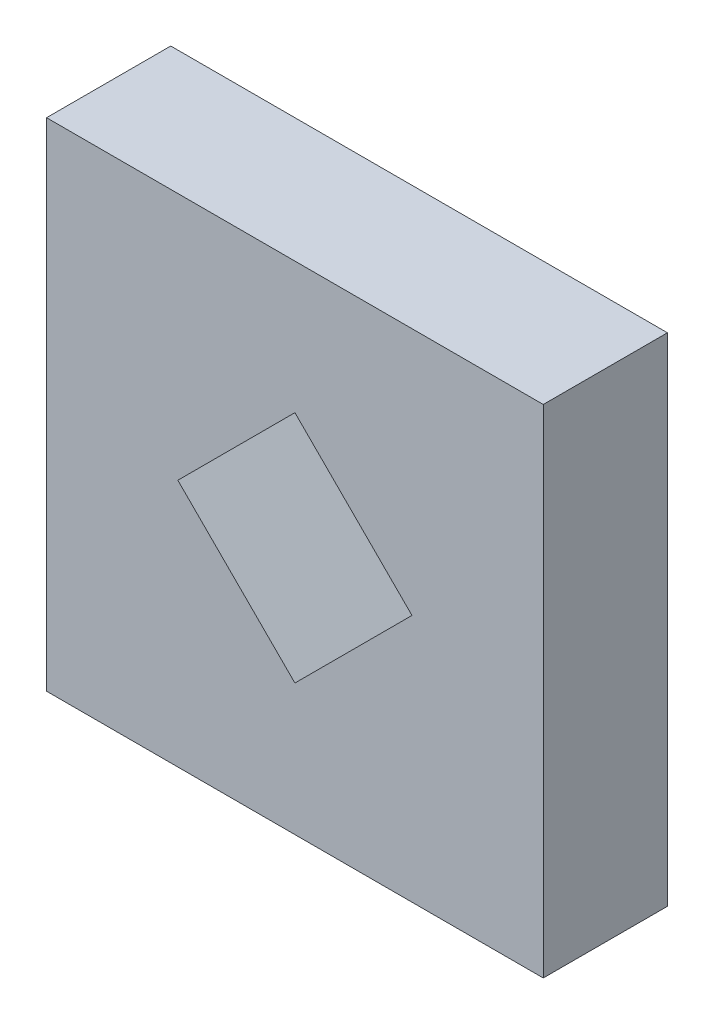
ISO-10303-21;
HEADER;
FILE_DESCRIPTION(('STEP AP214'),'2;1');
FILE_NAME('part.step','',(''),(''),'','','');
FILE_SCHEMA(('AUTOMOTIVE_DESIGN { 1 0 10303 214 1 1 1 1 }'));
ENDSEC;
DATA;
#1=APPLICATION_CONTEXT('core data for automotive mechanical design processes');
#2=APPLICATION_PROTOCOL_DEFINITION('international standard','automotive_design',2000,#1);
#3=PRODUCT_CONTEXT('',#1,'mechanical');
#4=PRODUCT('Part','Part','',(#3));
#5=PRODUCT_RELATED_PRODUCT_CATEGORY('part','',(#4));
#6=PRODUCT_DEFINITION_FORMATION('','',#4);
#7=PRODUCT_DEFINITION_CONTEXT('part definition',#1,'design');
#8=PRODUCT_DEFINITION('design','',#6,#7);
#9=PRODUCT_DEFINITION_SHAPE('','',#8);
#10=(LENGTH_UNIT() NAMED_UNIT(*) SI_UNIT(.MILLI.,.METRE.));
#11=(NAMED_UNIT(*) PLANE_ANGLE_UNIT() SI_UNIT($,.RADIAN.));
#12=(NAMED_UNIT(*) SI_UNIT($,.STERADIAN.) SOLID_ANGLE_UNIT());
#13=UNCERTAINTY_MEASURE_WITH_UNIT(LENGTH_MEASURE(1.E-05),#10,'distance_accuracy_value','');
#14=(GEOMETRIC_REPRESENTATION_CONTEXT(3) GLOBAL_UNCERTAINTY_ASSIGNED_CONTEXT((#13)) GLOBAL_UNIT_ASSIGNED_CONTEXT((#10,
#11,#12)) REPRESENTATION_CONTEXT('',''));
#15=CARTESIAN_POINT('',(0.,0.,0.));
#16=DIRECTION('',(0.,0.,1.));
#17=DIRECTION('',(1.,0.,0.));
#18=AXIS2_PLACEMENT_3D('',#15,#16,#17);
#19=CARTESIAN_POINT('',(-38.1,38.1,9.525));
#20=DIRECTION('',(1.,0.,0.));
#21=DIRECTION('',(0.,1.,0.));
#22=AXIS2_PLACEMENT_3D('',#19,#20,#21);
#23=PLANE('',#22);
#24=DIRECTION('',(0.,-1.,0.));
#25=VECTOR('',#24,1.);
#26=CARTESIAN_POINT('',(-38.1,38.1,-9.525));
#27=LINE('',#26,#25);
#28=CARTESIAN_POINT('',(-38.1,38.1,-9.525));
#29=VERTEX_POINT('',#28);
#30=CARTESIAN_POINT('',(-38.1,-38.1,-9.525));
#31=VERTEX_POINT('',#30);
#32=EDGE_CURVE('E129',#29,#31,#27,.T.);
#33=ORIENTED_EDGE('',*,*,#32,.T.);
#34=DIRECTION('',(0.,0.,-1.));
#35=VECTOR('',#34,1.);
#36=CARTESIAN_POINT('',(-38.1,-38.1,9.525));
#37=LINE('',#36,#35);
#38=CARTESIAN_POINT('',(-38.1,-38.1,9.525));
#39=VERTEX_POINT('',#38);
#40=EDGE_CURVE('E11',#39,#31,#37,.T.);
#41=ORIENTED_EDGE('',*,*,#40,.F.);
#42=DIRECTION('',(0.,-1.,0.));
#43=VECTOR('',#42,1.);
#44=CARTESIAN_POINT('',(-38.1,38.1,9.525));
#45=LINE('',#44,#43);
#46=CARTESIAN_POINT('',(-38.1,38.1,9.525));
#47=VERTEX_POINT('',#46);
#48=EDGE_CURVE('E133',#47,#39,#45,.T.);
#49=ORIENTED_EDGE('',*,*,#48,.F.);
#50=DIRECTION('',(0.,0.,-1.));
#51=VECTOR('',#50,1.);
#52=CARTESIAN_POINT('',(-38.1,38.1,9.525));
#53=LINE('',#52,#51);
#54=EDGE_CURVE('E143',#47,#29,#53,.T.);
#55=ORIENTED_EDGE('',*,*,#54,.T.);
#56=EDGE_LOOP('',(#33,#41,#49,#55));
#57=FACE_BOUND('',#56,.T.);
#58=ADVANCED_FACE('F32',(#57),#23,.F.);
#59=CARTESIAN_POINT('',(-38.1,-38.1,9.525));
#60=DIRECTION('',(0.,1.,0.));
#61=DIRECTION('',(0.,0.,1.));
#62=AXIS2_PLACEMENT_3D('',#59,#60,#61);
#63=PLANE('',#62);
#64=DIRECTION('',(1.,0.,0.));
#65=VECTOR('',#64,1.);
#66=CARTESIAN_POINT('',(-38.1,-38.1,-9.525));
#67=LINE('',#66,#65);
#68=CARTESIAN_POINT('',(38.1,-38.1,-9.525));
#69=VERTEX_POINT('',#68);
#70=EDGE_CURVE('E146',#31,#69,#67,.T.);
#71=ORIENTED_EDGE('',*,*,#70,.T.);
#72=DIRECTION('',(0.,0.,-1.));
#73=VECTOR('',#72,1.);
#74=CARTESIAN_POINT('',(38.1,-38.1,9.525));
#75=LINE('',#74,#73);
#76=CARTESIAN_POINT('',(38.1,-38.1,9.525));
#77=VERTEX_POINT('',#76);
#78=EDGE_CURVE('E39',#77,#69,#75,.T.);
#79=ORIENTED_EDGE('',*,*,#78,.F.);
#80=DIRECTION('',(1.,0.,0.));
#81=VECTOR('',#80,1.);
#82=CARTESIAN_POINT('',(-38.1,-38.1,9.525));
#83=LINE('',#82,#81);
#84=EDGE_CURVE('E136',#39,#77,#83,.T.);
#85=ORIENTED_EDGE('',*,*,#84,.F.);
#86=ORIENTED_EDGE('',*,*,#40,.T.);
#87=EDGE_LOOP('',(#71,#79,#85,#86));
#88=FACE_BOUND('',#87,.T.);
#89=ADVANCED_FACE('F174',(#88),#63,.F.);
#90=CARTESIAN_POINT('',(38.1,38.1,9.525));
#91=DIRECTION('',(-1.,0.,0.));
#92=DIRECTION('',(0.,-1.,0.));
#93=AXIS2_PLACEMENT_3D('',#90,#91,#92);
#94=PLANE('',#93);
#95=DIRECTION('',(0.,1.,0.));
#96=VECTOR('',#95,1.);
#97=CARTESIAN_POINT('',(38.1,38.1,-9.525));
#98=LINE('',#97,#96);
#99=CARTESIAN_POINT('',(38.1,38.1,-9.525));
#100=VERTEX_POINT('',#99);
#101=EDGE_CURVE('E148',#69,#100,#98,.T.);
#102=ORIENTED_EDGE('',*,*,#101,.T.);
#103=DIRECTION('',(0.,0.,-1.));
#104=VECTOR('',#103,1.);
#105=CARTESIAN_POINT('',(38.1,38.1,9.525));
#106=LINE('',#105,#104);
#107=CARTESIAN_POINT('',(38.1,38.1,9.525));
#108=VERTEX_POINT('',#107);
#109=EDGE_CURVE('E153',#108,#100,#106,.T.);
#110=ORIENTED_EDGE('',*,*,#109,.F.);
#111=DIRECTION('',(0.,1.,0.));
#112=VECTOR('',#111,1.);
#113=CARTESIAN_POINT('',(38.1,38.1,9.525));
#114=LINE('',#113,#112);
#115=EDGE_CURVE('E139',#77,#108,#114,.T.);
#116=ORIENTED_EDGE('',*,*,#115,.F.);
#117=ORIENTED_EDGE('',*,*,#78,.T.);
#118=EDGE_LOOP('',(#102,#110,#116,#117));
#119=FACE_BOUND('',#118,.T.);
#120=ADVANCED_FACE('F160',(#119),#94,.F.);
#121=CARTESIAN_POINT('',(-38.1,38.1,9.525));
#122=DIRECTION('',(0.,-1.,0.));
#123=DIRECTION('',(0.,0.,-1.));
#124=AXIS2_PLACEMENT_3D('',#121,#122,#123);
#125=PLANE('',#124);
#126=DIRECTION('',(-1.,0.,0.));
#127=VECTOR('',#126,1.);
#128=CARTESIAN_POINT('',(-38.1,38.1,-9.525));
#129=LINE('',#128,#127);
#130=EDGE_CURVE('E137',#100,#29,#129,.T.);
#131=ORIENTED_EDGE('',*,*,#130,.T.);
#132=ORIENTED_EDGE('',*,*,#54,.F.);
#133=DIRECTION('',(-1.,0.,0.));
#134=VECTOR('',#133,1.);
#135=CARTESIAN_POINT('',(-38.1,38.1,9.525));
#136=LINE('',#135,#134);
#137=EDGE_CURVE('E141',#108,#47,#136,.T.);
#138=ORIENTED_EDGE('',*,*,#137,.F.);
#139=ORIENTED_EDGE('',*,*,#109,.T.);
#140=EDGE_LOOP('',(#131,#132,#138,#139));
#141=FACE_BOUND('',#140,.T.);
#142=ADVANCED_FACE('F167',(#141),#125,.F.);
#143=CARTESIAN_POINT('',(0.,0.,9.525));
#144=DIRECTION('',(0.,0.,1.));
#145=DIRECTION('',(1.,0.,0.));
#146=AXIS2_PLACEMENT_3D('',#143,#144,#145);
#147=PLANE('',#146);
#148=DIRECTION('',(0.707106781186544,-0.707106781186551,0.));
#149=VECTOR('',#148,1.);
#150=CARTESIAN_POINT('',(3.13694700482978E-13,-17.9605122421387,9.525));
#151=LINE('',#150,#149);
#152=CARTESIAN_POINT('',(-17.9605122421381,-1.14463030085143E-13,9.525));
#153=VERTEX_POINT('',#152);
#154=CARTESIAN_POINT('',(3.13984949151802E-13,-17.9605122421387,9.525));
#155=VERTEX_POINT('',#154);
#156=EDGE_CURVE('E46',#153,#155,#151,.T.);
#157=ORIENTED_EDGE('',*,*,#156,.F.);
#158=DIRECTION('',(-0.707106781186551,-0.707106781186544,0.));
#159=VECTOR('',#158,1.);
#160=CARTESIAN_POINT('',(-17.9605122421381,-1.14463030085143E-13,9.525));
#161=LINE('',#160,#159);
#162=CARTESIAN_POINT('',(3.02816462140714E-13,17.9605122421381,9.525));
#163=VERTEX_POINT('',#162);
#164=EDGE_CURVE('E114',#163,#153,#161,.T.);
#165=ORIENTED_EDGE('',*,*,#164,.F.);
#166=DIRECTION('',(-0.707106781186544,0.707106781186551,0.));
#167=VECTOR('',#166,1.);
#168=CARTESIAN_POINT('',(3.02816462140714E-13,17.9605122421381,9.525));
#169=LINE('',#168,#167);
#170=CARTESIAN_POINT('',(17.9605122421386,-4.1058703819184E-13,9.525));
#171=VERTEX_POINT('',#170);
#172=EDGE_CURVE('E117',#171,#163,#169,.T.);
#173=ORIENTED_EDGE('',*,*,#172,.F.);
#174=DIRECTION('',(0.707106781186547,0.707106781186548,0.));
#175=VECTOR('',#174,1.);
#176=CARTESIAN_POINT('',(17.9605122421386,-4.1058703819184E-13,9.525));
#177=LINE('',#176,#175);
#178=EDGE_CURVE('E123',#155,#171,#177,.T.);
#179=ORIENTED_EDGE('',*,*,#178,.F.);
#180=EDGE_LOOP('',(#157,#165,#173,#179));
#181=FACE_BOUND('',#180,.T.);
#182=ORIENTED_EDGE('',*,*,#48,.T.);
#183=ORIENTED_EDGE('',*,*,#84,.T.);
#184=ORIENTED_EDGE('',*,*,#115,.T.);
#185=ORIENTED_EDGE('',*,*,#137,.T.);
#186=EDGE_LOOP('',(#182,#183,#184,#185));
#187=FACE_BOUND('',#186,.T.);
#188=ADVANCED_FACE('F173',(#181,#187),#147,.T.);
#189=CARTESIAN_POINT('',(0.,0.,-9.525));
#190=DIRECTION('',(0.,0.,1.));
#191=DIRECTION('',(1.,0.,0.));
#192=AXIS2_PLACEMENT_3D('',#189,#190,#191);
#193=PLANE('',#192);
#194=DIRECTION('',(-0.707106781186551,-0.707106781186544,0.));
#195=VECTOR('',#194,1.);
#196=CARTESIAN_POINT('',(-17.9605122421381,-1.14463030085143E-13,-9.525));
#197=LINE('',#196,#195);
#198=CARTESIAN_POINT('',(3.02816462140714E-13,17.9605122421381,-9.525));
#199=VERTEX_POINT('',#198);
#200=CARTESIAN_POINT('',(-17.9605122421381,-1.14463030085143E-13,-9.525));
#201=VERTEX_POINT('',#200);
#202=EDGE_CURVE('E104',#199,#201,#197,.T.);
#203=ORIENTED_EDGE('',*,*,#202,.T.);
#204=DIRECTION('',(0.707106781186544,-0.707106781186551,0.));
#205=VECTOR('',#204,1.);
#206=CARTESIAN_POINT('',(3.13694700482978E-13,-17.9605122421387,-9.525));
#207=LINE('',#206,#205);
#208=CARTESIAN_POINT('',(3.13694700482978E-13,-17.9605122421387,-9.525));
#209=VERTEX_POINT('',#208);
#210=EDGE_CURVE('E98',#201,#209,#207,.T.);
#211=ORIENTED_EDGE('',*,*,#210,.T.);
#212=DIRECTION('',(0.707106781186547,0.707106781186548,0.));
#213=VECTOR('',#212,1.);
#214=CARTESIAN_POINT('',(17.9605122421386,-4.1058703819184E-13,-9.525));
#215=LINE('',#214,#213);
#216=CARTESIAN_POINT('',(17.9605122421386,-4.11129463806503E-13,-9.525));
#217=VERTEX_POINT('',#216);
#218=EDGE_CURVE('E107',#209,#217,#215,.T.);
#219=ORIENTED_EDGE('',*,*,#218,.T.);
#220=DIRECTION('',(-0.707106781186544,0.707106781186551,0.));
#221=VECTOR('',#220,1.);
#222=CARTESIAN_POINT('',(3.02816462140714E-13,17.9605122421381,-9.525));
#223=LINE('',#222,#221);
#224=EDGE_CURVE('E54',#217,#199,#223,.T.);
#225=ORIENTED_EDGE('',*,*,#224,.T.);
#226=EDGE_LOOP('',(#203,#211,#219,#225));
#227=FACE_BOUND('',#226,.T.);
#228=ORIENTED_EDGE('',*,*,#32,.F.);
#229=ORIENTED_EDGE('',*,*,#130,.F.);
#230=ORIENTED_EDGE('',*,*,#101,.F.);
#231=ORIENTED_EDGE('',*,*,#70,.F.);
#232=EDGE_LOOP('',(#228,#229,#230,#231));
#233=FACE_BOUND('',#232,.T.);
#234=ADVANCED_FACE('F111',(#227,#233),#193,.F.);
#235=CARTESIAN_POINT('',(3.13694700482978E-13,-17.9605122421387,-9.525));
#236=DIRECTION('',(-0.707106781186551,-0.707106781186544,0.));
#237=DIRECTION('',(0.707106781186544,-0.707106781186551,0.));
#238=AXIS2_PLACEMENT_3D('',#235,#236,#237);
#239=PLANE('',#238);
#240=ORIENTED_EDGE('',*,*,#156,.T.);
#241=DIRECTION('',(0.,0.,1.));
#242=VECTOR('',#241,1.);
#243=CARTESIAN_POINT('',(3.13694700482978E-13,-17.9605122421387,-9.525));
#244=LINE('',#243,#242);
#245=EDGE_CURVE('E94',#209,#155,#244,.T.);
#246=ORIENTED_EDGE('',*,*,#245,.F.);
#247=ORIENTED_EDGE('',*,*,#210,.F.);
#248=DIRECTION('',(0.,0.,1.));
#249=VECTOR('',#248,1.);
#250=CARTESIAN_POINT('',(-17.9605122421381,-1.14463030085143E-13,-9.525));
#251=LINE('',#250,#249);
#252=EDGE_CURVE('E127',#201,#153,#251,.T.);
#253=ORIENTED_EDGE('',*,*,#252,.T.);
#254=EDGE_LOOP('',(#240,#246,#247,#253));
#255=FACE_BOUND('',#254,.T.);
#256=ADVANCED_FACE('F96',(#255),#239,.F.);
#257=CARTESIAN_POINT('',(-17.9605122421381,-1.14463030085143E-13,-9.525));
#258=DIRECTION('',(-0.707106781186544,0.707106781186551,0.));
#259=DIRECTION('',(-0.707106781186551,-0.707106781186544,0.));
#260=AXIS2_PLACEMENT_3D('',#257,#258,#259);
#261=PLANE('',#260);
#262=ORIENTED_EDGE('',*,*,#164,.T.);
#263=ORIENTED_EDGE('',*,*,#252,.F.);
#264=ORIENTED_EDGE('',*,*,#202,.F.);
#265=DIRECTION('',(0.,0.,1.));
#266=VECTOR('',#265,1.);
#267=CARTESIAN_POINT('',(3.02816462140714E-13,17.9605122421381,-9.525));
#268=LINE('',#267,#266);
#269=EDGE_CURVE('E130',#199,#163,#268,.T.);
#270=ORIENTED_EDGE('',*,*,#269,.T.);
#271=EDGE_LOOP('',(#262,#263,#264,#270));
#272=FACE_BOUND('',#271,.T.);
#273=ADVANCED_FACE('F191',(#272),#261,.F.);
#274=CARTESIAN_POINT('',(3.02816462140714E-13,17.9605122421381,-9.525));
#275=DIRECTION('',(0.707106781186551,0.707106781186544,0.));
#276=DIRECTION('',(-0.707106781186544,0.707106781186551,0.));
#277=AXIS2_PLACEMENT_3D('',#274,#275,#276);
#278=PLANE('',#277);
#279=ORIENTED_EDGE('',*,*,#172,.T.);
#280=ORIENTED_EDGE('',*,*,#269,.F.);
#281=ORIENTED_EDGE('',*,*,#224,.F.);
#282=DIRECTION('',(0.,0.,1.));
#283=VECTOR('',#282,1.);
#284=CARTESIAN_POINT('',(17.9605122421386,-4.1058703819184E-13,-9.525));
#285=LINE('',#284,#283);
#286=EDGE_CURVE('E103',#217,#171,#285,.T.);
#287=ORIENTED_EDGE('',*,*,#286,.T.);
#288=EDGE_LOOP('',(#279,#280,#281,#287));
#289=FACE_BOUND('',#288,.T.);
#290=ADVANCED_FACE('F194',(#289),#278,.F.);
#291=CARTESIAN_POINT('',(17.9605122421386,-4.1058703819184E-13,-9.525));
#292=DIRECTION('',(0.707106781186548,-0.707106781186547,0.));
#293=DIRECTION('',(0.707106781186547,0.707106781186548,0.));
#294=AXIS2_PLACEMENT_3D('',#291,#292,#293);
#295=PLANE('',#294);
#296=ORIENTED_EDGE('',*,*,#178,.T.);
#297=ORIENTED_EDGE('',*,*,#286,.F.);
#298=ORIENTED_EDGE('',*,*,#218,.F.);
#299=ORIENTED_EDGE('',*,*,#245,.T.);
#300=EDGE_LOOP('',(#296,#297,#298,#299));
#301=FACE_BOUND('',#300,.T.);
#302=ADVANCED_FACE('F108',(#301),#295,.F.);
#303=CLOSED_SHELL('',(#58,#89,#120,#142,#188,#234,#256,#273,#290,#302));
#304=MANIFOLD_SOLID_BREP('B2',#303);
#305=ADVANCED_BREP_SHAPE_REPRESENTATION('',(#18,#304),#14);
#306=SHAPE_DEFINITION_REPRESENTATION(#9,#305);
ENDSEC;
END-ISO-10303-21;
